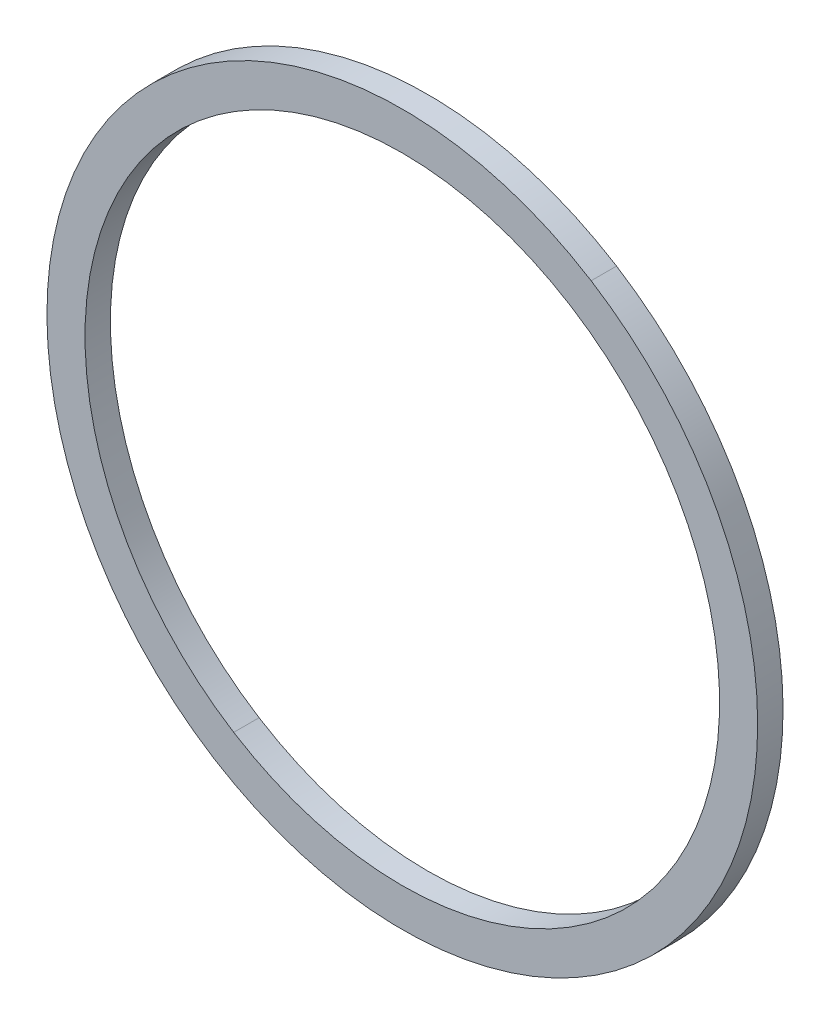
ISO-10303-21;
HEADER;
FILE_DESCRIPTION(('STEP AP214'),'2;1');
FILE_NAME('part.step','',(''),(''),'','','');
FILE_SCHEMA(('AUTOMOTIVE_DESIGN { 1 0 10303 214 1 1 1 1 }'));
ENDSEC;
DATA;
#1=APPLICATION_CONTEXT('core data for automotive mechanical design processes');
#2=APPLICATION_PROTOCOL_DEFINITION('international standard','automotive_design',2000,#1);
#3=PRODUCT_CONTEXT('',#1,'mechanical');
#4=PRODUCT('Part','Part','',(#3));
#5=PRODUCT_RELATED_PRODUCT_CATEGORY('part','',(#4));
#6=PRODUCT_DEFINITION_FORMATION('','',#4);
#7=PRODUCT_DEFINITION_CONTEXT('part definition',#1,'design');
#8=PRODUCT_DEFINITION('design','',#6,#7);
#9=PRODUCT_DEFINITION_SHAPE('','',#8);
#10=(LENGTH_UNIT() NAMED_UNIT(*) SI_UNIT(.MILLI.,.METRE.));
#11=(NAMED_UNIT(*) PLANE_ANGLE_UNIT() SI_UNIT($,.RADIAN.));
#12=(NAMED_UNIT(*) SI_UNIT($,.STERADIAN.) SOLID_ANGLE_UNIT());
#13=UNCERTAINTY_MEASURE_WITH_UNIT(LENGTH_MEASURE(1.E-05),#10,'distance_accuracy_value','');
#14=(GEOMETRIC_REPRESENTATION_CONTEXT(3) GLOBAL_UNCERTAINTY_ASSIGNED_CONTEXT((#13)) GLOBAL_UNIT_ASSIGNED_CONTEXT((#10,
#11,#12)) REPRESENTATION_CONTEXT('',''));
#15=CARTESIAN_POINT('',(0.,0.,0.));
#16=DIRECTION('',(0.,0.,1.));
#17=DIRECTION('',(1.,0.,0.));
#18=AXIS2_PLACEMENT_3D('',#15,#16,#17);
#19=CARTESIAN_POINT('',(0.,0.,0.));
#20=DIRECTION('',(0.,0.,-1.));
#21=DIRECTION('',(0.531373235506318,0.847137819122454,0.));
#22=AXIS2_PLACEMENT_3D('',#19,#20,#21);
#23=CYLINDRICAL_SURFACE('',#22,31.25);
#24=DIRECTION('',(0.,0.,-1.));
#25=VECTOR('',#24,1.);
#26=CARTESIAN_POINT('',(-16.6054136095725,-26.4730568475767,0.));
#27=LINE('',#26,#25);
#28=CARTESIAN_POINT('',(-16.6054136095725,-26.4730568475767,0.));
#29=VERTEX_POINT('',#28);
#30=CARTESIAN_POINT('',(-16.6054136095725,-26.4730568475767,-2.5));
#31=VERTEX_POINT('',#30);
#32=EDGE_CURVE('E70',#29,#31,#27,.T.);
#33=ORIENTED_EDGE('',*,*,#32,.F.);
#34=CARTESIAN_POINT('',(0.,0.,0.));
#35=DIRECTION('',(0.,0.,1.));
#36=DIRECTION('',(-0.531373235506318,-0.847137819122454,0.));
#37=AXIS2_PLACEMENT_3D('',#34,#35,#36);
#38=CIRCLE('',#37,31.25);
#39=CARTESIAN_POINT('',(16.6054136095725,26.4730568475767,0.));
#40=VERTEX_POINT('',#39);
#41=EDGE_CURVE('E65',#29,#40,#38,.T.);
#42=ORIENTED_EDGE('',*,*,#41,.T.);
#43=DIRECTION('',(0.,0.,-1.));
#44=VECTOR('',#43,1.);
#45=CARTESIAN_POINT('',(16.6054136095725,26.4730568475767,0.));
#46=LINE('',#45,#44);
#47=CARTESIAN_POINT('',(16.6054136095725,26.4730568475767,-2.5));
#48=VERTEX_POINT('',#47);
#49=EDGE_CURVE('E67',#40,#48,#46,.T.);
#50=ORIENTED_EDGE('',*,*,#49,.T.);
#51=CARTESIAN_POINT('',(0.,0.,-2.5));
#52=DIRECTION('',(0.,0.,1.));
#53=DIRECTION('',(-0.531373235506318,-0.847137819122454,0.));
#54=AXIS2_PLACEMENT_3D('',#51,#52,#53);
#55=CIRCLE('',#54,31.25);
#56=EDGE_CURVE('E11',#31,#48,#55,.T.);
#57=ORIENTED_EDGE('',*,*,#56,.F.);
#58=EDGE_LOOP('',(#33,#42,#50,#57));
#59=FACE_BOUND('',#58,.T.);
#60=ADVANCED_FACE('F16',(#59),#23,.F.);
#61=CARTESIAN_POINT('',(0.,0.,0.));
#62=DIRECTION('',(0.,0.,-1.));
#63=DIRECTION('',(0.531373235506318,0.847137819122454,0.));
#64=AXIS2_PLACEMENT_3D('',#61,#62,#63);
#65=CYLINDRICAL_SURFACE('',#64,35.);
#66=DIRECTION('',(0.,0.,-1.));
#67=VECTOR('',#66,1.);
#68=CARTESIAN_POINT('',(-18.5980632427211,-29.6498236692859,0.));
#69=LINE('',#68,#67);
#70=CARTESIAN_POINT('',(-18.5980632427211,-29.6498236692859,0.));
#71=VERTEX_POINT('',#70);
#72=CARTESIAN_POINT('',(-18.5980632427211,-29.6498236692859,-2.5));
#73=VERTEX_POINT('',#72);
#74=EDGE_CURVE('E102',#71,#73,#69,.T.);
#75=ORIENTED_EDGE('',*,*,#74,.F.);
#76=CARTESIAN_POINT('',(0.,0.,0.));
#77=DIRECTION('',(0.,0.,1.));
#78=DIRECTION('',(-0.531373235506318,-0.847137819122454,0.));
#79=AXIS2_PLACEMENT_3D('',#76,#77,#78);
#80=CIRCLE('',#79,35.);
#81=CARTESIAN_POINT('',(18.5980632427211,29.6498236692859,0.));
#82=VERTEX_POINT('',#81);
#83=EDGE_CURVE('E75',#82,#71,#80,.T.);
#84=ORIENTED_EDGE('',*,*,#83,.F.);
#85=DIRECTION('',(0.,0.,-1.));
#86=VECTOR('',#85,1.);
#87=CARTESIAN_POINT('',(18.5980632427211,29.6498236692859,0.));
#88=LINE('',#87,#86);
#89=CARTESIAN_POINT('',(18.5980632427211,29.6498236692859,-2.5));
#90=VERTEX_POINT('',#89);
#91=EDGE_CURVE('E93',#82,#90,#88,.T.);
#92=ORIENTED_EDGE('',*,*,#91,.T.);
#93=CARTESIAN_POINT('',(0.,0.,-2.5));
#94=DIRECTION('',(0.,0.,1.));
#95=DIRECTION('',(-0.531373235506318,-0.847137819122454,0.));
#96=AXIS2_PLACEMENT_3D('',#93,#94,#95);
#97=CIRCLE('',#96,35.);
#98=EDGE_CURVE('E24',#90,#73,#97,.T.);
#99=ORIENTED_EDGE('',*,*,#98,.T.);
#100=EDGE_LOOP('',(#75,#84,#92,#99));
#101=FACE_BOUND('',#100,.T.);
#102=ADVANCED_FACE('F114',(#101),#65,.T.);
#103=CARTESIAN_POINT('',(0.,0.,-2.5));
#104=DIRECTION('',(0.,0.,1.));
#105=DIRECTION('',(-0.531373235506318,-0.847137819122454,0.));
#106=AXIS2_PLACEMENT_3D('',#103,#104,#105);
#107=PLANE('',#106);
#108=CARTESIAN_POINT('',(0.,0.,-2.5));
#109=DIRECTION('',(0.,0.,1.));
#110=DIRECTION('',(-0.531373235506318,-0.847137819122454,0.));
#111=AXIS2_PLACEMENT_3D('',#108,#109,#110);
#112=CIRCLE('',#111,31.25);
#113=EDGE_CURVE('E80',#48,#31,#112,.T.);
#114=ORIENTED_EDGE('',*,*,#113,.T.);
#115=ORIENTED_EDGE('',*,*,#56,.T.);
#116=EDGE_LOOP('',(#114,#115));
#117=FACE_BOUND('',#116,.T.);
#118=ORIENTED_EDGE('',*,*,#98,.F.);
#119=CARTESIAN_POINT('',(0.,0.,-2.5));
#120=DIRECTION('',(0.,0.,1.));
#121=DIRECTION('',(-0.531373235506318,-0.847137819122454,0.));
#122=AXIS2_PLACEMENT_3D('',#119,#120,#121);
#123=CIRCLE('',#122,35.);
#124=EDGE_CURVE('E106',#73,#90,#123,.T.);
#125=ORIENTED_EDGE('',*,*,#124,.F.);
#126=EDGE_LOOP('',(#118,#125));
#127=FACE_BOUND('',#126,.T.);
#128=ADVANCED_FACE('F118',(#117,#127),#107,.F.);
#129=CARTESIAN_POINT('',(0.,0.,0.));
#130=DIRECTION('',(0.,0.,1.));
#131=DIRECTION('',(-0.531373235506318,-0.847137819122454,0.));
#132=AXIS2_PLACEMENT_3D('',#129,#130,#131);
#133=PLANE('',#132);
#134=CARTESIAN_POINT('',(0.,0.,0.));
#135=DIRECTION('',(0.,0.,1.));
#136=DIRECTION('',(-0.531373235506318,-0.847137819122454,0.));
#137=AXIS2_PLACEMENT_3D('',#134,#135,#136);
#138=CIRCLE('',#137,31.25);
#139=EDGE_CURVE('E78',#40,#29,#138,.T.);
#140=ORIENTED_EDGE('',*,*,#139,.F.);
#141=ORIENTED_EDGE('',*,*,#41,.F.);
#142=EDGE_LOOP('',(#140,#141));
#143=FACE_BOUND('',#142,.T.);
#144=ORIENTED_EDGE('',*,*,#83,.T.);
#145=CARTESIAN_POINT('',(0.,0.,0.));
#146=DIRECTION('',(0.,0.,1.));
#147=DIRECTION('',(-0.531373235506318,-0.847137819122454,0.));
#148=AXIS2_PLACEMENT_3D('',#145,#146,#147);
#149=CIRCLE('',#148,35.);
#150=EDGE_CURVE('E82',#71,#82,#149,.T.);
#151=ORIENTED_EDGE('',*,*,#150,.T.);
#152=EDGE_LOOP('',(#144,#151));
#153=FACE_BOUND('',#152,.T.);
#154=ADVANCED_FACE('F84',(#143,#153),#133,.T.);
#155=CARTESIAN_POINT('',(0.,0.,0.));
#156=DIRECTION('',(0.,0.,-1.));
#157=DIRECTION('',(0.531373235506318,0.847137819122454,0.));
#158=AXIS2_PLACEMENT_3D('',#155,#156,#157);
#159=CYLINDRICAL_SURFACE('',#158,35.);
#160=ORIENTED_EDGE('',*,*,#150,.F.);
#161=ORIENTED_EDGE('',*,*,#74,.T.);
#162=ORIENTED_EDGE('',*,*,#124,.T.);
#163=ORIENTED_EDGE('',*,*,#91,.F.);
#164=EDGE_LOOP('',(#160,#161,#162,#163));
#165=FACE_BOUND('',#164,.T.);
#166=ADVANCED_FACE('F117',(#165),#159,.T.);
#167=CARTESIAN_POINT('',(0.,0.,0.));
#168=DIRECTION('',(0.,0.,-1.));
#169=DIRECTION('',(0.531373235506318,0.847137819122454,0.));
#170=AXIS2_PLACEMENT_3D('',#167,#168,#169);
#171=CYLINDRICAL_SURFACE('',#170,31.25);
#172=ORIENTED_EDGE('',*,*,#139,.T.);
#173=ORIENTED_EDGE('',*,*,#32,.T.);
#174=ORIENTED_EDGE('',*,*,#113,.F.);
#175=ORIENTED_EDGE('',*,*,#49,.F.);
#176=EDGE_LOOP('',(#172,#173,#174,#175));
#177=FACE_BOUND('',#176,.T.);
#178=ADVANCED_FACE('F77',(#177),#171,.F.);
#179=CLOSED_SHELL('',(#60,#102,#128,#154,#166,#178));
#180=MANIFOLD_SOLID_BREP('B1',#179);
#181=ADVANCED_BREP_SHAPE_REPRESENTATION('',(#18,#180),#14);
#182=SHAPE_DEFINITION_REPRESENTATION(#9,#181);
ENDSEC;
END-ISO-10303-21;
